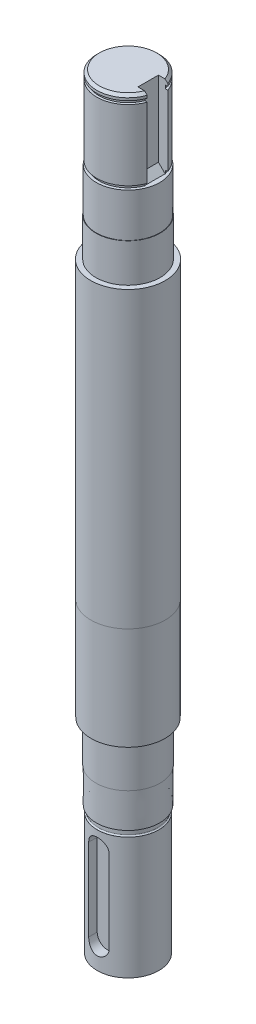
ISO-10303-21;
HEADER;
FILE_DESCRIPTION(('STEP AP214'),'2;1');
FILE_NAME('part.step','',(''),(''),'','','');
FILE_SCHEMA(('AUTOMOTIVE_DESIGN { 1 0 10303 214 1 1 1 1 }'));
ENDSEC;
DATA;
#1=APPLICATION_CONTEXT('core data for automotive mechanical design processes');
#2=APPLICATION_PROTOCOL_DEFINITION('international standard','automotive_design',2000,#1);
#3=PRODUCT_CONTEXT('',#1,'mechanical');
#4=PRODUCT('Part','Part','',(#3));
#5=PRODUCT_RELATED_PRODUCT_CATEGORY('part','',(#4));
#6=PRODUCT_DEFINITION_FORMATION('','',#4);
#7=PRODUCT_DEFINITION_CONTEXT('part definition',#1,'design');
#8=PRODUCT_DEFINITION('design','',#6,#7);
#9=PRODUCT_DEFINITION_SHAPE('','',#8);
#10=(LENGTH_UNIT() NAMED_UNIT(*) SI_UNIT(.MILLI.,.METRE.));
#11=(NAMED_UNIT(*) PLANE_ANGLE_UNIT() SI_UNIT($,.RADIAN.));
#12=(NAMED_UNIT(*) SI_UNIT($,.STERADIAN.) SOLID_ANGLE_UNIT());
#13=UNCERTAINTY_MEASURE_WITH_UNIT(LENGTH_MEASURE(1.E-05),#10,'distance_accuracy_value','');
#14=(GEOMETRIC_REPRESENTATION_CONTEXT(3) GLOBAL_UNCERTAINTY_ASSIGNED_CONTEXT((#13)) GLOBAL_UNIT_ASSIGNED_CONTEXT((#10,
#11,#12)) REPRESENTATION_CONTEXT('',''));
#15=CARTESIAN_POINT('',(0.,0.,0.));
#16=DIRECTION('',(0.,0.,1.));
#17=DIRECTION('',(1.,0.,0.));
#18=AXIS2_PLACEMENT_3D('',#15,#16,#17);
#19=CARTESIAN_POINT('',(12.,50.,0.));
#20=DIRECTION('',(0.,-1.,0.));
#21=DIRECTION('',(0.,0.,-1.));
#22=AXIS2_PLACEMENT_3D('',#19,#20,#21);
#23=PLANE('',#22);
#24=CARTESIAN_POINT('',(0.,50.,0.));
#25=DIRECTION('',(0.,-1.,0.));
#26=DIRECTION('',(0.,0.,-1.));
#27=AXIS2_PLACEMENT_3D('',#24,#25,#26);
#28=CIRCLE('',#27,12.35);
#29=CARTESIAN_POINT('',(0.,50.,-12.35));
#30=VERTEX_POINT('',#29);
#31=EDGE_CURVE('E297',#30,#30,#28,.T.);
#32=ORIENTED_EDGE('',*,*,#31,.T.);
#33=EDGE_LOOP('',(#32));
#34=FACE_BOUND('',#33,.T.);
#35=CARTESIAN_POINT('',(0.,50.,0.));
#36=DIRECTION('',(0.,-1.,0.));
#37=DIRECTION('',(0.,0.,-1.));
#38=AXIS2_PLACEMENT_3D('',#35,#36,#37);
#39=CIRCLE('',#38,11.99);
#40=CARTESIAN_POINT('',(0.,50.,-11.99));
#41=VERTEX_POINT('',#40);
#42=EDGE_CURVE('E221',#41,#41,#39,.T.);
#43=ORIENTED_EDGE('',*,*,#42,.F.);
#44=EDGE_LOOP('',(#43));
#45=FACE_BOUND('',#44,.T.);
#46=ADVANCED_FACE('F35',(#34,#45),#23,.T.);
#47=CARTESIAN_POINT('',(0.,50.,0.));
#48=DIRECTION('',(0.,-1.,0.));
#49=DIRECTION('',(0.,0.,-1.));
#50=AXIS2_PLACEMENT_3D('',#47,#48,#49);
#51=CONICAL_SURFACE('',#50,12.35,0.000540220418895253);
#52=CARTESIAN_POINT('',(0.,63.5,0.));
#53=DIRECTION('',(0.,-1.,0.));
#54=DIRECTION('',(0.,0.,-1.));
#55=AXIS2_PLACEMENT_3D('',#52,#53,#54);
#56=CIRCLE('',#55,12.3427070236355);
#57=CARTESIAN_POINT('',(0.,63.5,-12.3427070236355));
#58=VERTEX_POINT('',#57);
#59=EDGE_CURVE('E294',#58,#58,#56,.T.);
#60=ORIENTED_EDGE('',*,*,#59,.T.);
#61=EDGE_LOOP('',(#60));
#62=FACE_BOUND('',#61,.T.);
#63=ORIENTED_EDGE('',*,*,#31,.F.);
#64=EDGE_LOOP('',(#63));
#65=FACE_BOUND('',#64,.T.);
#66=ADVANCED_FACE('F378',(#62,#65),#51,.T.);
#67=CARTESIAN_POINT('',(12.5,63.5,0.));
#68=DIRECTION('',(0.,-1.,0.));
#69=DIRECTION('',(0.,0.,-1.));
#70=AXIS2_PLACEMENT_3D('',#67,#68,#69);
#71=PLANE('',#70);
#72=CARTESIAN_POINT('',(0.,63.5,0.));
#73=DIRECTION('',(0.,-1.,0.));
#74=DIRECTION('',(0.,0.,-1.));
#75=AXIS2_PLACEMENT_3D('',#72,#73,#74);
#76=CIRCLE('',#75,12.5);
#77=CARTESIAN_POINT('',(0.,63.5,-12.5));
#78=VERTEX_POINT('',#77);
#79=EDGE_CURVE('E291',#78,#78,#76,.T.);
#80=ORIENTED_EDGE('',*,*,#79,.T.);
#81=EDGE_LOOP('',(#80));
#82=FACE_BOUND('',#81,.T.);
#83=ORIENTED_EDGE('',*,*,#59,.F.);
#84=EDGE_LOOP('',(#83));
#85=FACE_BOUND('',#84,.T.);
#86=ADVANCED_FACE('F383',(#82,#85),#71,.T.);
#87=CARTESIAN_POINT('',(0.,326.056951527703,0.));
#88=DIRECTION('',(0.,-1.,0.));
#89=DIRECTION('',(0.,0.,-1.));
#90=AXIS2_PLACEMENT_3D('',#87,#88,#89);
#91=CYLINDRICAL_SURFACE('',#90,12.5);
#92=CARTESIAN_POINT('',(0.,79.5,0.));
#93=DIRECTION('',(0.,-1.,0.));
#94=DIRECTION('',(0.,0.,-1.));
#95=AXIS2_PLACEMENT_3D('',#92,#93,#94);
#96=CIRCLE('',#95,12.5);
#97=CARTESIAN_POINT('',(0.,79.5,-12.5));
#98=VERTEX_POINT('',#97);
#99=EDGE_CURVE('E288',#98,#98,#96,.T.);
#100=ORIENTED_EDGE('',*,*,#99,.T.);
#101=EDGE_LOOP('',(#100));
#102=FACE_BOUND('',#101,.T.);
#103=ORIENTED_EDGE('',*,*,#79,.F.);
#104=EDGE_LOOP('',(#103));
#105=FACE_BOUND('',#104,.T.);
#106=ADVANCED_FACE('F390',(#102,#105),#91,.T.);
#107=CARTESIAN_POINT('',(12.5,79.5,0.));
#108=DIRECTION('',(0.,-1.,0.));
#109=DIRECTION('',(0.,0.,-1.));
#110=AXIS2_PLACEMENT_3D('',#107,#108,#109);
#111=PLANE('',#110);
#112=CARTESIAN_POINT('',(0.,79.5,0.));
#113=DIRECTION('',(0.,-1.,0.));
#114=DIRECTION('',(0.,0.,-1.));
#115=AXIS2_PLACEMENT_3D('',#112,#113,#114);
#116=CIRCLE('',#115,14.4);
#117=CARTESIAN_POINT('',(0.,79.5,-14.4));
#118=VERTEX_POINT('',#117);
#119=EDGE_CURVE('E285',#118,#118,#116,.T.);
#120=ORIENTED_EDGE('',*,*,#119,.T.);
#121=EDGE_LOOP('',(#120));
#122=FACE_BOUND('',#121,.T.);
#123=ORIENTED_EDGE('',*,*,#99,.F.);
#124=EDGE_LOOP('',(#123));
#125=FACE_BOUND('',#124,.T.);
#126=ADVANCED_FACE('F394',(#122,#125),#111,.T.);
#127=CARTESIAN_POINT('',(0.,326.056951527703,0.));
#128=DIRECTION('',(0.,-1.,0.));
#129=DIRECTION('',(0.,0.,-1.));
#130=AXIS2_PLACEMENT_3D('',#127,#128,#129);
#131=CYLINDRICAL_SURFACE('',#130,14.4);
#132=CARTESIAN_POINT('',(0.,119.5,0.));
#133=DIRECTION('',(0.,-1.,0.));
#134=DIRECTION('',(0.,0.,-1.));
#135=AXIS2_PLACEMENT_3D('',#132,#133,#134);
#136=CIRCLE('',#135,14.4);
#137=CARTESIAN_POINT('',(0.,119.5,-14.4));
#138=VERTEX_POINT('',#137);
#139=EDGE_CURVE('E282',#138,#138,#136,.T.);
#140=ORIENTED_EDGE('',*,*,#139,.T.);
#141=EDGE_LOOP('',(#140));
#142=FACE_BOUND('',#141,.T.);
#143=ORIENTED_EDGE('',*,*,#119,.F.);
#144=EDGE_LOOP('',(#143));
#145=FACE_BOUND('',#144,.T.);
#146=ADVANCED_FACE('F398',(#142,#145),#131,.T.);
#147=CARTESIAN_POINT('',(14.5,119.5,0.));
#148=DIRECTION('',(0.,-1.,0.));
#149=DIRECTION('',(0.,0.,-1.));
#150=AXIS2_PLACEMENT_3D('',#147,#148,#149);
#151=PLANE('',#150);
#152=CARTESIAN_POINT('',(0.,119.5,0.));
#153=DIRECTION('',(0.,-1.,0.));
#154=DIRECTION('',(0.,0.,-1.));
#155=AXIS2_PLACEMENT_3D('',#152,#153,#154);
#156=CIRCLE('',#155,14.5);
#157=CARTESIAN_POINT('',(0.,119.5,-14.5));
#158=VERTEX_POINT('',#157);
#159=EDGE_CURVE('E279',#158,#158,#156,.T.);
#160=ORIENTED_EDGE('',*,*,#159,.T.);
#161=EDGE_LOOP('',(#160));
#162=FACE_BOUND('',#161,.T.);
#163=ORIENTED_EDGE('',*,*,#139,.F.);
#164=EDGE_LOOP('',(#163));
#165=FACE_BOUND('',#164,.T.);
#166=ADVANCED_FACE('F402',(#162,#165),#151,.T.);
#167=CARTESIAN_POINT('',(0.,326.056951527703,0.));
#168=DIRECTION('',(0.,-1.,0.));
#169=DIRECTION('',(0.,0.,-1.));
#170=AXIS2_PLACEMENT_3D('',#167,#168,#169);
#171=CYLINDRICAL_SURFACE('',#170,14.5);
#172=CARTESIAN_POINT('',(0.,234.,0.));
#173=DIRECTION('',(0.,-1.,0.));
#174=DIRECTION('',(0.,0.,-1.));
#175=AXIS2_PLACEMENT_3D('',#172,#173,#174);
#176=CIRCLE('',#175,14.5000000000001);
#177=CARTESIAN_POINT('',(0.,234.,-14.5000000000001));
#178=VERTEX_POINT('',#177);
#179=EDGE_CURVE('E276',#178,#178,#176,.T.);
#180=ORIENTED_EDGE('',*,*,#179,.T.);
#181=EDGE_LOOP('',(#180));
#182=FACE_BOUND('',#181,.T.);
#183=ORIENTED_EDGE('',*,*,#159,.F.);
#184=EDGE_LOOP('',(#183));
#185=FACE_BOUND('',#184,.T.);
#186=ADVANCED_FACE('F406',(#182,#185),#171,.T.);
#187=CARTESIAN_POINT('',(14.5000000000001,234.,0.));
#188=DIRECTION('',(0.,1.,0.));
#189=DIRECTION('',(0.,0.,1.));
#190=AXIS2_PLACEMENT_3D('',#187,#188,#189);
#191=PLANE('',#190);
#192=CARTESIAN_POINT('',(0.,234.,0.));
#193=DIRECTION('',(0.,-1.,0.));
#194=DIRECTION('',(0.,0.,-1.));
#195=AXIS2_PLACEMENT_3D('',#192,#193,#194);
#196=CIRCLE('',#195,12.5);
#197=CARTESIAN_POINT('',(0.,234.,-12.5));
#198=VERTEX_POINT('',#197);
#199=EDGE_CURVE('E273',#198,#198,#196,.T.);
#200=ORIENTED_EDGE('',*,*,#199,.T.);
#201=EDGE_LOOP('',(#200));
#202=FACE_BOUND('',#201,.T.);
#203=ORIENTED_EDGE('',*,*,#179,.F.);
#204=EDGE_LOOP('',(#203));
#205=FACE_BOUND('',#204,.T.);
#206=ADVANCED_FACE('F410',(#202,#205),#191,.T.);
#207=CARTESIAN_POINT('',(0.,326.056951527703,0.));
#208=DIRECTION('',(0.,-1.,0.));
#209=DIRECTION('',(0.,0.,-1.));
#210=AXIS2_PLACEMENT_3D('',#207,#208,#209);
#211=CYLINDRICAL_SURFACE('',#210,12.5);
#212=CARTESIAN_POINT('',(0.,249.,0.));
#213=DIRECTION('',(0.,-1.,0.));
#214=DIRECTION('',(0.,0.,-1.));
#215=AXIS2_PLACEMENT_3D('',#212,#213,#214);
#216=CIRCLE('',#215,12.5);
#217=CARTESIAN_POINT('',(0.,249.,-12.5));
#218=VERTEX_POINT('',#217);
#219=EDGE_CURVE('E270',#218,#218,#216,.T.);
#220=ORIENTED_EDGE('',*,*,#219,.T.);
#221=EDGE_LOOP('',(#220));
#222=FACE_BOUND('',#221,.T.);
#223=ORIENTED_EDGE('',*,*,#199,.F.);
#224=EDGE_LOOP('',(#223));
#225=FACE_BOUND('',#224,.T.);
#226=ADVANCED_FACE('F414',(#222,#225),#211,.T.);
#227=CARTESIAN_POINT('',(12.5,249.,0.));
#228=DIRECTION('',(0.,1.,0.));
#229=DIRECTION('',(0.,0.,1.));
#230=AXIS2_PLACEMENT_3D('',#227,#228,#229);
#231=PLANE('',#230);
#232=CARTESIAN_POINT('',(0.,249.,0.));
#233=DIRECTION('',(0.,-1.,0.));
#234=DIRECTION('',(0.,0.,-1.));
#235=AXIS2_PLACEMENT_3D('',#232,#233,#234);
#236=CIRCLE('',#235,12.35);
#237=CARTESIAN_POINT('',(0.,249.,-12.35));
#238=VERTEX_POINT('',#237);
#239=EDGE_CURVE('E267',#238,#238,#236,.T.);
#240=ORIENTED_EDGE('',*,*,#239,.T.);
#241=EDGE_LOOP('',(#240));
#242=FACE_BOUND('',#241,.T.);
#243=ORIENTED_EDGE('',*,*,#219,.F.);
#244=EDGE_LOOP('',(#243));
#245=FACE_BOUND('',#244,.T.);
#246=ADVANCED_FACE('F418',(#242,#245),#231,.T.);
#247=CARTESIAN_POINT('',(0.,326.056951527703,0.));
#248=DIRECTION('',(0.,-1.,0.));
#249=DIRECTION('',(0.,0.,-1.));
#250=AXIS2_PLACEMENT_3D('',#247,#248,#249);
#251=CYLINDRICAL_SURFACE('',#250,12.35);
#252=CARTESIAN_POINT('',(0.,266.,0.));
#253=DIRECTION('',(0.,-1.,0.));
#254=DIRECTION('',(0.,0.,-1.));
#255=AXIS2_PLACEMENT_3D('',#252,#253,#254);
#256=CIRCLE('',#255,12.35);
#257=CARTESIAN_POINT('',(0.,266.,-12.35));
#258=VERTEX_POINT('',#257);
#259=EDGE_CURVE('E264',#258,#258,#256,.T.);
#260=ORIENTED_EDGE('',*,*,#259,.T.);
#261=EDGE_LOOP('',(#260));
#262=FACE_BOUND('',#261,.T.);
#263=ORIENTED_EDGE('',*,*,#239,.F.);
#264=EDGE_LOOP('',(#263));
#265=FACE_BOUND('',#264,.T.);
#266=ADVANCED_FACE('F422',(#262,#265),#251,.T.);
#267=CARTESIAN_POINT('',(12.35,266.,0.));
#268=DIRECTION('',(0.,1.,0.));
#269=DIRECTION('',(0.,0.,1.));
#270=AXIS2_PLACEMENT_3D('',#267,#268,#269);
#271=PLANE('',#270);
#272=DIRECTION('',(1.,0.,0.));
#273=VECTOR('',#272,1.);
#274=CARTESIAN_POINT('',(7.85,266.,-4.));
#275=LINE('',#274,#273);
#276=CARTESIAN_POINT('',(10.45,266.,-4.));
#277=VERTEX_POINT('',#276);
#278=CARTESIAN_POINT('',(10.5226729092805,266.,-3.99999999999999));
#279=VERTEX_POINT('',#278);
#280=EDGE_CURVE('E170',#277,#279,#275,.T.);
#281=ORIENTED_EDGE('',*,*,#280,.F.);
#282=DIRECTION('',(0.,0.,1.));
#283=VECTOR('',#282,1.);
#284=CARTESIAN_POINT('',(10.45,266.,4.));
#285=LINE('',#284,#283);
#286=CARTESIAN_POINT('',(10.45,266.,4.));
#287=VERTEX_POINT('',#286);
#288=EDGE_CURVE('E43',#277,#287,#285,.T.);
#289=ORIENTED_EDGE('',*,*,#288,.T.);
#290=DIRECTION('',(1.,0.,0.));
#291=VECTOR('',#290,1.);
#292=CARTESIAN_POINT('',(7.85,266.,4.));
#293=LINE('',#292,#291);
#294=CARTESIAN_POINT('',(10.5226729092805,266.,4.));
#295=VERTEX_POINT('',#294);
#296=EDGE_CURVE('E168',#287,#295,#293,.T.);
#297=ORIENTED_EDGE('',*,*,#296,.T.);
#298=CARTESIAN_POINT('',(0.,266.,0.));
#299=DIRECTION('',(0.,-1.,0.));
#300=DIRECTION('',(0.,0.,-1.));
#301=AXIS2_PLACEMENT_3D('',#298,#299,#300);
#302=CIRCLE('',#301,11.2572929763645);
#303=EDGE_CURVE('E261',#295,#279,#302,.T.);
#304=ORIENTED_EDGE('',*,*,#303,.T.);
#305=EDGE_LOOP('',(#281,#289,#297,#304));
#306=FACE_BOUND('',#305,.T.);
#307=ORIENTED_EDGE('',*,*,#259,.F.);
#308=EDGE_LOOP('',(#307));
#309=FACE_BOUND('',#308,.T.);
#310=ADVANCED_FACE('F426',(#306,#309),#271,.T.);
#311=CARTESIAN_POINT('',(0.,326.056951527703,0.));
#312=DIRECTION('',(0.,-1.,0.));
#313=DIRECTION('',(0.,0.,-1.));
#314=AXIS2_PLACEMENT_3D('',#311,#312,#313);
#315=CYLINDRICAL_SURFACE('',#314,11.2572929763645);
#316=DIRECTION('',(0.,-1.,0.));
#317=VECTOR('',#316,1.);
#318=CARTESIAN_POINT('',(10.5226729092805,326.056951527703,-4.));
#319=LINE('',#318,#317);
#320=CARTESIAN_POINT('',(10.5226729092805,267.3,-4.));
#321=VERTEX_POINT('',#320);
#322=EDGE_CURVE('E203',#279,#321,#319,.F.);
#323=ORIENTED_EDGE('',*,*,#322,.F.);
#324=ORIENTED_EDGE('',*,*,#303,.F.);
#325=DIRECTION('',(0.,-1.,0.));
#326=VECTOR('',#325,1.);
#327=CARTESIAN_POINT('',(10.5226729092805,326.056951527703,4.));
#328=LINE('',#327,#326);
#329=CARTESIAN_POINT('',(10.5226729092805,267.3,4.));
#330=VERTEX_POINT('',#329);
#331=EDGE_CURVE('E188',#330,#295,#328,.T.);
#332=ORIENTED_EDGE('',*,*,#331,.F.);
#333=CARTESIAN_POINT('',(0.,267.3,0.));
#334=DIRECTION('',(0.,-1.,0.));
#335=DIRECTION('',(0.,0.,-1.));
#336=AXIS2_PLACEMENT_3D('',#333,#334,#335);
#337=CIRCLE('',#336,11.2572929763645);
#338=EDGE_CURVE('E258',#330,#321,#337,.T.);
#339=ORIENTED_EDGE('',*,*,#338,.T.);
#340=EDGE_LOOP('',(#323,#324,#332,#339));
#341=FACE_BOUND('',#340,.T.);
#342=ADVANCED_FACE('F430',(#341),#315,.T.);
#343=CARTESIAN_POINT('',(11.2572929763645,267.3,0.));
#344=DIRECTION('',(0.,-1.,0.));
#345=DIRECTION('',(0.,0.,-1.));
#346=AXIS2_PLACEMENT_3D('',#343,#344,#345);
#347=PLANE('',#346);
#348=DIRECTION('',(1.,0.,0.));
#349=VECTOR('',#348,1.);
#350=CARTESIAN_POINT('',(11.2572929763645,267.3,-4.));
#351=LINE('',#350,#349);
#352=CARTESIAN_POINT('',(11.472684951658,267.3,-4.));
#353=VERTEX_POINT('',#352);
#354=EDGE_CURVE('E201',#321,#353,#351,.T.);
#355=ORIENTED_EDGE('',*,*,#354,.F.);
#356=ORIENTED_EDGE('',*,*,#338,.F.);
#357=DIRECTION('',(-1.,0.,0.));
#358=VECTOR('',#357,1.);
#359=CARTESIAN_POINT('',(11.2572929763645,267.3,4.));
#360=LINE('',#359,#358);
#361=CARTESIAN_POINT('',(11.472684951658,267.3,4.));
#362=VERTEX_POINT('',#361);
#363=EDGE_CURVE('E186',#362,#330,#360,.T.);
#364=ORIENTED_EDGE('',*,*,#363,.F.);
#365=CARTESIAN_POINT('',(0.,267.3,0.));
#366=DIRECTION('',(0.,-1.,0.));
#367=DIRECTION('',(0.,0.,-1.));
#368=AXIS2_PLACEMENT_3D('',#365,#366,#367);
#369=CIRCLE('',#368,12.15);
#370=EDGE_CURVE('E255',#362,#353,#369,.T.);
#371=ORIENTED_EDGE('',*,*,#370,.T.);
#372=EDGE_LOOP('',(#355,#356,#364,#371));
#373=FACE_BOUND('',#372,.T.);
#374=ADVANCED_FACE('F433',(#373),#347,.T.);
#375=CARTESIAN_POINT('',(0.,326.056951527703,0.));
#376=DIRECTION('',(0.,-1.,0.));
#377=DIRECTION('',(0.,0.,-1.));
#378=AXIS2_PLACEMENT_3D('',#375,#376,#377);
#379=CYLINDRICAL_SURFACE('',#378,12.15);
#380=DIRECTION('',(0.,-1.,0.));
#381=VECTOR('',#380,1.);
#382=CARTESIAN_POINT('',(11.472684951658,326.056951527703,-4.));
#383=LINE('',#382,#381);
#384=CARTESIAN_POINT('',(11.472684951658,294.7,-4.));
#385=VERTEX_POINT('',#384);
#386=EDGE_CURVE('E199',#353,#385,#383,.F.);
#387=ORIENTED_EDGE('',*,*,#386,.F.);
#388=ORIENTED_EDGE('',*,*,#370,.F.);
#389=DIRECTION('',(0.,-1.,0.));
#390=VECTOR('',#389,1.);
#391=CARTESIAN_POINT('',(11.472684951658,326.056951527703,4.));
#392=LINE('',#391,#390);
#393=CARTESIAN_POINT('',(11.472684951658,294.7,4.));
#394=VERTEX_POINT('',#393);
#395=EDGE_CURVE('E184',#394,#362,#392,.T.);
#396=ORIENTED_EDGE('',*,*,#395,.F.);
#397=CARTESIAN_POINT('',(0.,294.7,0.));
#398=DIRECTION('',(0.,-1.,0.));
#399=DIRECTION('',(0.,0.,-1.));
#400=AXIS2_PLACEMENT_3D('',#397,#398,#399);
#401=CIRCLE('',#400,12.15);
#402=EDGE_CURVE('E252',#394,#385,#401,.T.);
#403=ORIENTED_EDGE('',*,*,#402,.T.);
#404=EDGE_LOOP('',(#387,#388,#396,#403));
#405=FACE_BOUND('',#404,.T.);
#406=ADVANCED_FACE('F437',(#405),#379,.T.);
#407=CARTESIAN_POINT('',(11.2499999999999,294.7,0.));
#408=DIRECTION('',(0.,1.,0.));
#409=DIRECTION('',(0.,0.,1.));
#410=AXIS2_PLACEMENT_3D('',#407,#408,#409);
#411=PLANE('',#410);
#412=DIRECTION('',(-1.,0.,0.));
#413=VECTOR('',#412,1.);
#414=CARTESIAN_POINT('',(11.2499999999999,294.7,-4.));
#415=LINE('',#414,#413);
#416=CARTESIAN_POINT('',(10.5148704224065,294.7,-4.));
#417=VERTEX_POINT('',#416);
#418=EDGE_CURVE('E197',#385,#417,#415,.T.);
#419=ORIENTED_EDGE('',*,*,#418,.F.);
#420=ORIENTED_EDGE('',*,*,#402,.F.);
#421=DIRECTION('',(1.,0.,0.));
#422=VECTOR('',#421,1.);
#423=CARTESIAN_POINT('',(11.2499999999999,294.7,4.));
#424=LINE('',#423,#422);
#425=CARTESIAN_POINT('',(10.5148704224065,294.7,4.));
#426=VERTEX_POINT('',#425);
#427=EDGE_CURVE('E182',#426,#394,#424,.T.);
#428=ORIENTED_EDGE('',*,*,#427,.F.);
#429=CARTESIAN_POINT('',(0.,294.7,0.));
#430=DIRECTION('',(0.,-1.,0.));
#431=DIRECTION('',(0.,0.,-1.));
#432=AXIS2_PLACEMENT_3D('',#429,#430,#431);
#433=CIRCLE('',#432,11.2499999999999);
#434=EDGE_CURVE('E249',#426,#417,#433,.T.);
#435=ORIENTED_EDGE('',*,*,#434,.T.);
#436=EDGE_LOOP('',(#419,#420,#428,#435));
#437=FACE_BOUND('',#436,.T.);
#438=ADVANCED_FACE('F441',(#437),#411,.T.);
#439=CARTESIAN_POINT('',(0.,326.056951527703,0.));
#440=DIRECTION('',(0.,-1.,0.));
#441=DIRECTION('',(0.,0.,-1.));
#442=AXIS2_PLACEMENT_3D('',#439,#440,#441);
#443=CYLINDRICAL_SURFACE('',#442,11.2499999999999);
#444=DIRECTION('',(0.,-1.,0.));
#445=VECTOR('',#444,1.);
#446=CARTESIAN_POINT('',(10.5148704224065,326.056951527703,-4.));
#447=LINE('',#446,#445);
#448=CARTESIAN_POINT('',(10.5148704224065,296.,-4.));
#449=VERTEX_POINT('',#448);
#450=EDGE_CURVE('E195',#417,#449,#447,.F.);
#451=ORIENTED_EDGE('',*,*,#450,.F.);
#452=ORIENTED_EDGE('',*,*,#434,.F.);
#453=DIRECTION('',(0.,-1.,0.));
#454=VECTOR('',#453,1.);
#455=CARTESIAN_POINT('',(10.5148704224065,326.056951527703,4.));
#456=LINE('',#455,#454);
#457=CARTESIAN_POINT('',(10.5148704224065,296.,4.));
#458=VERTEX_POINT('',#457);
#459=EDGE_CURVE('E180',#458,#426,#456,.T.);
#460=ORIENTED_EDGE('',*,*,#459,.F.);
#461=CARTESIAN_POINT('',(0.,296.,0.));
#462=DIRECTION('',(0.,-1.,0.));
#463=DIRECTION('',(0.,0.,-1.));
#464=AXIS2_PLACEMENT_3D('',#461,#462,#463);
#465=CIRCLE('',#464,11.2499999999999);
#466=EDGE_CURVE('E246',#458,#449,#465,.T.);
#467=ORIENTED_EDGE('',*,*,#466,.T.);
#468=EDGE_LOOP('',(#451,#452,#460,#467));
#469=FACE_BOUND('',#468,.T.);
#470=ADVANCED_FACE('F445',(#469),#443,.T.);
#471=CARTESIAN_POINT('',(12.15,296.,0.));
#472=DIRECTION('',(0.,-1.,0.));
#473=DIRECTION('',(0.,0.,-1.));
#474=AXIS2_PLACEMENT_3D('',#471,#472,#473);
#475=PLANE('',#474);
#476=DIRECTION('',(1.,0.,0.));
#477=VECTOR('',#476,1.);
#478=CARTESIAN_POINT('',(12.15,296.,-4.));
#479=LINE('',#478,#477);
#480=CARTESIAN_POINT('',(11.472684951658,296.,-4.));
#481=VERTEX_POINT('',#480);
#482=EDGE_CURVE('E193',#449,#481,#479,.T.);
#483=ORIENTED_EDGE('',*,*,#482,.F.);
#484=ORIENTED_EDGE('',*,*,#466,.F.);
#485=DIRECTION('',(-1.,0.,0.));
#486=VECTOR('',#485,1.);
#487=CARTESIAN_POINT('',(12.15,296.,4.));
#488=LINE('',#487,#486);
#489=CARTESIAN_POINT('',(11.472684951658,296.,4.));
#490=VERTEX_POINT('',#489);
#491=EDGE_CURVE('E177',#490,#458,#488,.T.);
#492=ORIENTED_EDGE('',*,*,#491,.F.);
#493=CARTESIAN_POINT('',(0.,296.,0.));
#494=DIRECTION('',(0.,-1.,0.));
#495=DIRECTION('',(0.,0.,-1.));
#496=AXIS2_PLACEMENT_3D('',#493,#494,#495);
#497=CIRCLE('',#496,12.15);
#498=EDGE_CURVE('E243',#490,#481,#497,.T.);
#499=ORIENTED_EDGE('',*,*,#498,.T.);
#500=EDGE_LOOP('',(#483,#484,#492,#499));
#501=FACE_BOUND('',#500,.T.);
#502=ADVANCED_FACE('F449',(#501),#475,.T.);
#503=CARTESIAN_POINT('',(0.,326.056951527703,0.));
#504=DIRECTION('',(0.,-1.,0.));
#505=DIRECTION('',(0.,0.,-1.));
#506=AXIS2_PLACEMENT_3D('',#503,#504,#505);
#507=CYLINDRICAL_SURFACE('',#506,12.15);
#508=DIRECTION('',(0.,-1.,0.));
#509=VECTOR('',#508,1.);
#510=CARTESIAN_POINT('',(11.472684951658,326.056951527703,-4.));
#511=LINE('',#510,#509);
#512=CARTESIAN_POINT('',(11.472684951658,297.,-4.));
#513=VERTEX_POINT('',#512);
#514=EDGE_CURVE('E191',#481,#513,#511,.F.);
#515=ORIENTED_EDGE('',*,*,#514,.F.);
#516=ORIENTED_EDGE('',*,*,#498,.F.);
#517=DIRECTION('',(0.,-1.,0.));
#518=VECTOR('',#517,1.);
#519=CARTESIAN_POINT('',(11.472684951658,326.056951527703,4.));
#520=LINE('',#519,#518);
#521=CARTESIAN_POINT('',(11.472684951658,297.,4.));
#522=VERTEX_POINT('',#521);
#523=EDGE_CURVE('E175',#522,#490,#520,.T.);
#524=ORIENTED_EDGE('',*,*,#523,.F.);
#525=CARTESIAN_POINT('',(0.,297.,0.));
#526=DIRECTION('',(0.,1.,0.));
#527=DIRECTION('',(0.,0.,1.));
#528=AXIS2_PLACEMENT_3D('',#525,#526,#527);
#529=CIRCLE('',#528,12.15);
#530=EDGE_CURVE('E303',#522,#513,#529,.F.);
#531=ORIENTED_EDGE('',*,*,#530,.T.);
#532=EDGE_LOOP('',(#515,#516,#524,#531));
#533=FACE_BOUND('',#532,.T.);
#534=ADVANCED_FACE('F453',(#533),#507,.T.);
#535=CARTESIAN_POINT('',(12.15,298.,0.));
#536=DIRECTION('',(0.,1.,0.));
#537=DIRECTION('',(0.,0.,1.));
#538=AXIS2_PLACEMENT_3D('',#535,#536,#537);
#539=PLANE('',#538);
#540=DIRECTION('',(1.,0.,0.));
#541=VECTOR('',#540,1.);
#542=CARTESIAN_POINT('',(7.85,298.,-4.));
#543=LINE('',#542,#541);
#544=CARTESIAN_POINT('',(7.85,298.,-4.));
#545=VERTEX_POINT('',#544);
#546=CARTESIAN_POINT('',(10.4078095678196,298.,-4.));
#547=VERTEX_POINT('',#546);
#548=EDGE_CURVE('E178',#545,#547,#543,.T.);
#549=ORIENTED_EDGE('',*,*,#548,.T.);
#550=CARTESIAN_POINT('',(0.,298.,0.));
#551=DIRECTION('',(0.,1.,0.));
#552=DIRECTION('',(0.,0.,1.));
#553=AXIS2_PLACEMENT_3D('',#550,#551,#552);
#554=CIRCLE('',#553,11.1499999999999);
#555=CARTESIAN_POINT('',(10.4078095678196,298.,4.));
#556=VERTEX_POINT('',#555);
#557=EDGE_CURVE('E167',#547,#556,#554,.T.);
#558=ORIENTED_EDGE('',*,*,#557,.T.);
#559=DIRECTION('',(1.,0.,0.));
#560=VECTOR('',#559,1.);
#561=CARTESIAN_POINT('',(7.85,298.,4.));
#562=LINE('',#561,#560);
#563=CARTESIAN_POINT('',(7.85,298.,4.));
#564=VERTEX_POINT('',#563);
#565=EDGE_CURVE('E149',#564,#556,#562,.T.);
#566=ORIENTED_EDGE('',*,*,#565,.F.);
#567=DIRECTION('',(0.,0.,1.));
#568=VECTOR('',#567,1.);
#569=CARTESIAN_POINT('',(7.85,298.,4.));
#570=LINE('',#569,#568);
#571=EDGE_CURVE('E156',#545,#564,#570,.T.);
#572=ORIENTED_EDGE('',*,*,#571,.F.);
#573=EDGE_LOOP('',(#549,#558,#566,#572));
#574=FACE_BOUND('',#573,.T.);
#575=ADVANCED_FACE('F165',(#574),#539,.T.);
#576=CARTESIAN_POINT('',(0.,297.,0.));
#577=DIRECTION('',(0.,-1.,0.));
#578=DIRECTION('',(0.,0.,-1.));
#579=AXIS2_PLACEMENT_3D('',#576,#577,#578);
#580=CONICAL_SURFACE('',#579,12.15,0.785398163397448);
#581=CARTESIAN_POINT('',(16.7200622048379,291.958127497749,-4.));
#582=CARTESIAN_POINT('',(16.223932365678,292.440582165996,-4.));
#583=CARTESIAN_POINT('',(15.7272759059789,292.92249878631,-4.));
#584=CARTESIAN_POINT('',(14.7324625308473,293.88471369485,-4.));
#585=CARTESIAN_POINT('',(14.2343057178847,294.365012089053,-4.));
#586=CARTESIAN_POINT('',(13.236269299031,295.32323347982,-4.));
#587=CARTESIAN_POINT('',(12.7363908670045,295.801157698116,-4.));
#588=CARTESIAN_POINT('',(11.7338109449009,296.75411902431,-4.));
#589=CARTESIAN_POINT('',(11.2311092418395,297.229155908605,-4.));
#590=CARTESIAN_POINT('',(10.4738218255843,297.938700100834,-4.));
#591=CARTESIAN_POINT('',(10.2207427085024,298.174815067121,-4.));
#592=CARTESIAN_POINT('',(9.71334660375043,298.645708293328,-4.));
#593=CARTESIAN_POINT('',(9.45902962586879,298.880486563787,-4.));
#594=CARTESIAN_POINT('',(8.94891205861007,299.34833217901,-4.));
#595=CARTESIAN_POINT('',(8.69311175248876,299.581399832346,-4.));
#596=CARTESIAN_POINT('',(8.17958053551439,300.045417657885,-4.));
#597=CARTESIAN_POINT('',(7.92184956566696,300.2763677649,-4.));
#598=CARTESIAN_POINT('',(7.40373040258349,300.735676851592,-4.));
#599=CARTESIAN_POINT('',(7.14334031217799,300.964033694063,-4.));
#600=CARTESIAN_POINT('',(6.61937633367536,301.417035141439,-4.));
#601=CARTESIAN_POINT('',(6.35580272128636,301.641680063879,-4.));
#602=CARTESIAN_POINT('',(5.95714867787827,301.974880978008,-4.));
#603=CARTESIAN_POINT('',(5.82367153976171,302.085355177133,-4.));
#604=CARTESIAN_POINT('',(5.55546367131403,302.304766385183,-4.));
#605=CARTESIAN_POINT('',(5.42073297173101,302.413703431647,-4.));
#606=CARTESIAN_POINT('',(5.14976483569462,302.629772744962,-4.));
#607=CARTESIAN_POINT('',(5.01352697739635,302.736904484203,-4.));
#608=CARTESIAN_POINT('',(4.73929378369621,302.948916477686,-4.));
#609=CARTESIAN_POINT('',(4.60129830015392,303.05379654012,-4.));
#610=CARTESIAN_POINT('',(4.46229111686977,303.15733431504,-4.));
#611=B_SPLINE_CURVE_WITH_KNOTS('',3,(#581,#582,#583,#584,#585,#586,#587,#588,#589,#590,#591,
#592,#593,#594,#595,#596,#597,#598,#599,#600,#601,#602,#603,#604,#605,#606,#607,#608,#609,#610),
.UNSPECIFIED.,.F.,.F.,(4,2,2,2,2,2,2,2,2,2,2,2,2,2,4),(0.,2.07609728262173,4.15205585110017,
6.22680399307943,8.30171081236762,9.3400683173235,10.3784176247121,11.4165747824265,
12.4547637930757,13.4937540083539,14.5326548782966,15.0524402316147,15.5722128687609,
16.0921348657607,16.6121009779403),.UNSPECIFIED.);
#612=EDGE_CURVE('E358',#513,#547,#611,.T.);
#613=ORIENTED_EDGE('',*,*,#612,.F.);
#614=ORIENTED_EDGE('',*,*,#530,.F.);
#615=CARTESIAN_POINT('',(4.46229111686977,303.15733431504,4.));
#616=CARTESIAN_POINT('',(4.58005525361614,303.069628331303,4.));
#617=CARTESIAN_POINT('',(4.69708938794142,302.980951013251,4.));
#618=CARTESIAN_POINT('',(4.9298660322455,302.801929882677,4.));
#619=CARTESIAN_POINT('',(5.04560861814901,302.711586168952,4.));
#620=CARTESIAN_POINT('',(5.27595889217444,302.529518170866,4.));
#621=CARTESIAN_POINT('',(5.39056682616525,302.437794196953,4.));
#622=CARTESIAN_POINT('',(5.61881468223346,302.253147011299,4.));
#623=CARTESIAN_POINT('',(5.73245458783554,302.160223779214,4.));
#624=CARTESIAN_POINT('',(6.07198795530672,301.880016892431,4.));
#625=CARTESIAN_POINT('',(6.29661620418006,301.691199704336,4.));
#626=CARTESIAN_POINT('',(6.74326298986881,301.310485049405,4.));
#627=CARTESIAN_POINT('',(6.96528135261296,301.118587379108,4.));
#628=CARTESIAN_POINT('',(7.40707587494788,300.732563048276,4.));
#629=CARTESIAN_POINT('',(7.62685358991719,300.538438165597,4.));
#630=CARTESIAN_POINT('',(8.06473874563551,300.148326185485,4.));
#631=CARTESIAN_POINT('',(8.28284622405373,299.952339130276,4.));
#632=CARTESIAN_POINT('',(8.71772960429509,299.558845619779,4.));
#633=CARTESIAN_POINT('',(8.93450535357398,299.36133899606,4.));
#634=CARTESIAN_POINT('',(9.36693981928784,298.965106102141,4.));
#635=CARTESIAN_POINT('',(9.5825985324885,298.766379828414,4.));
#636=CARTESIAN_POINT('',(9.87539718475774,298.495300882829,4.));
#637=CARTESIAN_POINT('',(9.95294288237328,298.423385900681,4.));
#638=CARTESIAN_POINT('',(10.1079187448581,298.279434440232,4.));
#639=CARTESIAN_POINT('',(10.1853489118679,298.207397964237,4.));
#640=CARTESIAN_POINT('',(10.4174886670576,297.991105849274,4.));
#641=CARTESIAN_POINT('',(10.5720370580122,297.84667720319,4.));
#642=CARTESIAN_POINT('',(11.2313161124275,297.228960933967,4.));
#643=CARTESIAN_POINT('',(11.734224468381,296.753727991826,4.));
#644=CARTESIAN_POINT('',(12.7372584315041,295.800331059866,4.));
#645=CARTESIAN_POINT('',(13.2373840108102,295.322167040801,4.));
#646=CARTESIAN_POINT('',(14.2354612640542,294.363898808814,4.));
#647=CARTESIAN_POINT('',(14.7334135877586,293.883795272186,4.));
#648=CARTESIAN_POINT('',(15.7277734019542,292.922016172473,4.));
#649=CARTESIAN_POINT('',(16.2241809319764,292.440340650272,4.));
#650=CARTESIAN_POINT('',(16.7200622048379,291.958127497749,4.));
#651=B_SPLINE_CURVE_WITH_KNOTS('',3,(#615,#616,#617,#618,#619,#620,#621,#622,#623,#624,#625,
#626,#627,#628,#629,#630,#631,#632,#633,#634,#635,#636,#637,#638,#639,#640,#641,#642,#643,#644,
#645,#646,#647,#648,#649,#650),.UNSPECIFIED.,.F.,.F.,(4,2,2,2,2,2,2,2,2,2,2,2,2,2,2,2,2,4),(0.,
0.440494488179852,0.880962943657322,1.32133376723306,1.76171207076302,2.64200442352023,
3.52235515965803,4.40204627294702,5.28171748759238,6.16148765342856,7.04126036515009,
7.35853919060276,7.67581206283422,8.31040054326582,10.3861611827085,12.4619425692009,
14.5370537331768,16.6121113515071),.UNSPECIFIED.);
#652=EDGE_CURVE('E351',#556,#522,#651,.T.);
#653=ORIENTED_EDGE('',*,*,#652,.F.);
#654=ORIENTED_EDGE('',*,*,#557,.F.);
#655=EDGE_LOOP('',(#613,#614,#653,#654));
#656=FACE_BOUND('',#655,.T.);
#657=ADVANCED_FACE('F365',(#656),#580,.T.);
#658=CARTESIAN_POINT('',(12.,47.5,0.));
#659=DIRECTION('',(0.,-1.,0.));
#660=DIRECTION('',(0.,0.,-1.));
#661=AXIS2_PLACEMENT_3D('',#658,#659,#660);
#662=PLANE('',#661);
#663=CARTESIAN_POINT('',(0.,47.5,0.));
#664=DIRECTION('',(0.,-1.,0.));
#665=DIRECTION('',(0.,0.,-1.));
#666=AXIS2_PLACEMENT_3D('',#663,#664,#665);
#667=CIRCLE('',#666,12.);
#668=CARTESIAN_POINT('',(0.,47.5,-12.));
#669=VERTEX_POINT('',#668);
#670=EDGE_CURVE('E240',#669,#669,#667,.T.);
#671=ORIENTED_EDGE('',*,*,#670,.F.);
#672=EDGE_LOOP('',(#671));
#673=FACE_BOUND('',#672,.T.);
#674=CARTESIAN_POINT('',(0.,47.5,0.));
#675=DIRECTION('',(0.,-1.,0.));
#676=DIRECTION('',(0.,0.,-1.));
#677=AXIS2_PLACEMENT_3D('',#674,#675,#676);
#678=CIRCLE('',#677,11.99);
#679=CARTESIAN_POINT('',(0.,47.5,-11.99));
#680=VERTEX_POINT('',#679);
#681=EDGE_CURVE('E237',#680,#680,#678,.T.);
#682=ORIENTED_EDGE('',*,*,#681,.T.);
#683=EDGE_LOOP('',(#682));
#684=FACE_BOUND('',#683,.T.);
#685=ADVANCED_FACE('F460',(#673,#684),#662,.F.);
#686=CARTESIAN_POINT('',(0.,47.99,0.));
#687=DIRECTION('',(0.,-1.,0.));
#688=DIRECTION('',(0.,0.,-1.));
#689=AXIS2_PLACEMENT_3D('',#686,#687,#688);
#690=TOROIDAL_SURFACE('',#689,11.99,0.489999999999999);
#691=ORIENTED_EDGE('',*,*,#681,.F.);
#692=EDGE_LOOP('',(#691));
#693=FACE_BOUND('',#692,.T.);
#694=CARTESIAN_POINT('',(0.,47.99,0.));
#695=DIRECTION('',(0.,-1.,0.));
#696=DIRECTION('',(0.,0.,-1.));
#697=AXIS2_PLACEMENT_3D('',#694,#695,#696);
#698=CIRCLE('',#697,11.5);
#699=CARTESIAN_POINT('',(0.,47.99,-11.5));
#700=VERTEX_POINT('',#699);
#701=EDGE_CURVE('E234',#700,#700,#698,.T.);
#702=ORIENTED_EDGE('',*,*,#701,.T.);
#703=EDGE_LOOP('',(#702));
#704=FACE_BOUND('',#703,.T.);
#705=ADVANCED_FACE('F463',(#693,#704),#690,.F.);
#706=CARTESIAN_POINT('',(0.,0.,0.));
#707=DIRECTION('',(0.,-1.,0.));
#708=DIRECTION('',(0.,0.,-1.));
#709=AXIS2_PLACEMENT_3D('',#706,#707,#708);
#710=CYLINDRICAL_SURFACE('',#709,11.5);
#711=ORIENTED_EDGE('',*,*,#701,.F.);
#712=EDGE_LOOP('',(#711));
#713=FACE_BOUND('',#712,.T.);
#714=CARTESIAN_POINT('',(0.,49.51,0.));
#715=DIRECTION('',(0.,-1.,0.));
#716=DIRECTION('',(0.,0.,-1.));
#717=AXIS2_PLACEMENT_3D('',#714,#715,#716);
#718=CIRCLE('',#717,11.5);
#719=CARTESIAN_POINT('',(0.,49.51,-11.5));
#720=VERTEX_POINT('',#719);
#721=EDGE_CURVE('E231',#720,#720,#718,.T.);
#722=ORIENTED_EDGE('',*,*,#721,.T.);
#723=EDGE_LOOP('',(#722));
#724=FACE_BOUND('',#723,.T.);
#725=ADVANCED_FACE('F466',(#713,#724),#710,.T.);
#726=CARTESIAN_POINT('',(0.,49.51,0.));
#727=DIRECTION('',(0.,-1.,0.));
#728=DIRECTION('',(0.,0.,-1.));
#729=AXIS2_PLACEMENT_3D('',#726,#727,#728);
#730=TOROIDAL_SURFACE('',#729,11.99,0.489999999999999);
#731=ORIENTED_EDGE('',*,*,#721,.F.);
#732=EDGE_LOOP('',(#731));
#733=FACE_BOUND('',#732,.T.);
#734=ORIENTED_EDGE('',*,*,#42,.T.);
#735=EDGE_LOOP('',(#734));
#736=FACE_BOUND('',#735,.T.);
#737=ADVANCED_FACE('F339',(#733,#736),#730,.F.);
#738=CARTESIAN_POINT('',(0.,0.,0.));
#739=DIRECTION('',(0.,-1.,0.));
#740=DIRECTION('',(0.,0.,-1.));
#741=AXIS2_PLACEMENT_3D('',#738,#739,#740);
#742=PLANE('',#741);
#743=CARTESIAN_POINT('',(0.,0.,0.));
#744=DIRECTION('',(0.,-1.,0.));
#745=DIRECTION('',(0.,0.,-1.));
#746=AXIS2_PLACEMENT_3D('',#743,#744,#745);
#747=CIRCLE('',#746,12.);
#748=CARTESIAN_POINT('',(0.,0.,-12.));
#749=VERTEX_POINT('',#748);
#750=EDGE_CURVE('E300',#749,#749,#747,.T.);
#751=ORIENTED_EDGE('',*,*,#750,.T.);
#752=EDGE_LOOP('',(#751));
#753=FACE_BOUND('',#752,.T.);
#754=ADVANCED_FACE('F473',(#753),#742,.T.);
#755=CARTESIAN_POINT('',(0.,326.056951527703,0.));
#756=DIRECTION('',(0.,-1.,0.));
#757=DIRECTION('',(0.,0.,-1.));
#758=AXIS2_PLACEMENT_3D('',#755,#756,#757);
#759=CYLINDRICAL_SURFACE('',#758,12.);
#760=CARTESIAN_POINT('',(4.,41.,11.3137084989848));
#761=CARTESIAN_POINT('',(4.0000143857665,41.1091313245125,11.3136910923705));
#762=CARTESIAN_POINT('',(3.99553419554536,41.2182529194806,11.3152871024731));
#763=CARTESIAN_POINT('',(3.97769673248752,41.4356496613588,11.3215763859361));
#764=CARTESIAN_POINT('',(3.96434185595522,41.5439250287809,11.3262688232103));
#765=CARTESIAN_POINT('',(3.92891935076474,41.7585447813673,11.3386032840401));
#766=CARTESIAN_POINT('',(3.90687756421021,41.8648939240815,11.3462365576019));
#767=CARTESIAN_POINT('',(3.85430689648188,42.0752132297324,11.364201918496));
#768=CARTESIAN_POINT('',(3.82377770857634,42.1791833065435,11.3745341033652));
#769=CARTESIAN_POINT('',(3.71986482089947,42.4863385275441,11.4091190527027));
#770=CARTESIAN_POINT('',(3.63410266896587,42.685086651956,11.4369799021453));
#771=CARTESIAN_POINT('',(3.4322845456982,43.0654028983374,11.4991525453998));
#772=CARTESIAN_POINT('',(3.31620997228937,43.246960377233,11.5334682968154));
#773=CARTESIAN_POINT('',(3.05220793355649,43.5948686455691,11.6061789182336));
#774=CARTESIAN_POINT('',(2.90330055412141,43.7604562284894,11.6446750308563));
#775=CARTESIAN_POINT('',(2.57995313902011,44.0648273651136,11.7205540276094));
#776=CARTESIAN_POINT('',(2.40550856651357,44.203606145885,11.7579367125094));
#777=CARTESIAN_POINT('',(2.03041476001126,44.4539171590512,11.8285552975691));
#778=CARTESIAN_POINT('',(1.82920040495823,44.5646436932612,11.8616574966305));
#779=CARTESIAN_POINT('',(1.40971695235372,44.7503692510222,11.9187843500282));
#780=CARTESIAN_POINT('',(1.19145308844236,44.8253791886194,11.9428117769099));
#781=CARTESIAN_POINT('',(0.752117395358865,44.9349428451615,11.9783628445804));
#782=CARTESIAN_POINT('',(0.531407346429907,44.9708130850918,11.9902923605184));
#783=CARTESIAN_POINT('',(0.0867958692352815,45.0052651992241,12.0017443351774));
#784=CARTESIAN_POINT('',(-0.137104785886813,45.0038559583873,12.0012697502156));
#785=CARTESIAN_POINT('',(-0.572415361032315,44.9646229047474,11.9882415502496));
#786=CARTESIAN_POINT('',(-0.783970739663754,44.9282295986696,11.9761624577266));
#787=CARTESIAN_POINT('',(-1.19777632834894,44.8224270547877,11.9418784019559));
#788=CARTESIAN_POINT('',(-1.4000260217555,44.7530159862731,11.9196728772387));
#789=CARTESIAN_POINT('',(-1.79261022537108,44.5823150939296,11.8670267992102));
#790=CARTESIAN_POINT('',(-1.98275302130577,44.4806179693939,11.8364817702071));
#791=CARTESIAN_POINT('',(-2.34369935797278,44.2485580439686,11.7703352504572));
#792=CARTESIAN_POINT('',(-2.51449761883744,44.1181874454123,11.7347323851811));
#793=CARTESIAN_POINT('',(-2.84038544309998,43.8253242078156,11.6602518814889));
#794=CARTESIAN_POINT('',(-2.99435951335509,43.6616098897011,11.6212989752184));
#795=CARTESIAN_POINT('',(-3.27310303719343,43.3102019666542,11.5458957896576));
#796=CARTESIAN_POINT('',(-3.39786305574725,43.1225006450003,11.5094463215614));
#797=CARTESIAN_POINT('',(-3.56109757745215,42.8252870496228,11.4595759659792));
#798=CARTESIAN_POINT('',(-3.61182358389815,42.7227445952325,11.4436484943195));
#799=CARTESIAN_POINT('',(-3.70440095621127,42.5134350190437,11.4140167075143));
#800=CARTESIAN_POINT('',(-3.74625601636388,42.4066696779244,11.4003114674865));
#801=CARTESIAN_POINT('',(-3.82067426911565,42.1897829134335,11.3755873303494));
#802=CARTESIAN_POINT('',(-3.85324757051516,42.079665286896,11.3645655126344));
#803=CARTESIAN_POINT('',(-3.90883841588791,41.8568318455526,11.3455648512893));
#804=CARTESIAN_POINT('',(-3.93186032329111,41.7441172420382,11.3375846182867));
#805=CARTESIAN_POINT('',(-3.96661962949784,41.5263575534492,11.3254693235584));
#806=CARTESIAN_POINT('',(-3.97913375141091,41.4214504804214,11.3210705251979));
#807=CARTESIAN_POINT('',(-3.99582494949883,41.2110316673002,11.3151843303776));
#808=CARTESIAN_POINT('',(-4.00001278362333,41.1055208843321,11.3136931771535));
#809=CARTESIAN_POINT('',(-4.,41.,11.3137084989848));
#810=B_SPLINE_CURVE_WITH_KNOTS('',3,(#760,#761,#762,#763,#764,#765,#766,#767,#768,#769,#770,
#771,#772,#773,#774,#775,#776,#777,#778,#779,#780,#781,#782,#783,#784,#785,#786,#787,#788,#789,
#790,#791,#792,#793,#794,#795,#796,#797,#798,#799,#800,#801,#802,#803,#804,#805,#806,#807,#808,
#809),.UNSPECIFIED.,.F.,.F.,(4,2,2,2,2,2,2,2,2,2,2,2,2,2,2,2,2,2,2,2,2,2,2,2,4),(0.,
0.327273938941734,0.654459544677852,0.980679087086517,1.30691042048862,1.95841627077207,
2.61032287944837,3.28524582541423,3.96028882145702,4.65295094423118,5.34540127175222,
6.01376445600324,6.68196834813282,7.32396236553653,7.96599198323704,8.61646637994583,
9.26711789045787,9.94834778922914,10.6297973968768,10.9759539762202,11.3219661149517,
11.6675999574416,12.0130757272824,12.3299368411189,12.6463882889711),.UNSPECIFIED.);
#811=CARTESIAN_POINT('',(4.,41.,11.3137084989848));
#812=VERTEX_POINT('',#811);
#813=CARTESIAN_POINT('',(-4.,41.,11.3137084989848));
#814=VERTEX_POINT('',#813);
#815=EDGE_CURVE('E307',#812,#814,#810,.T.);
#816=ORIENTED_EDGE('',*,*,#815,.F.);
#817=DIRECTION('',(0.,-1.,0.));
#818=VECTOR('',#817,1.);
#819=CARTESIAN_POINT('',(4.,326.056951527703,11.3137084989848));
#820=LINE('',#819,#818);
#821=CARTESIAN_POINT('',(4.,9.,11.3137084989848));
#822=VERTEX_POINT('',#821);
#823=EDGE_CURVE('E348',#822,#812,#820,.F.);
#824=ORIENTED_EDGE('',*,*,#823,.F.);
#825=CARTESIAN_POINT('',(-4.,9.,11.3137084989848));
#826=CARTESIAN_POINT('',(-4.0000143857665,8.89086867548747,11.3136910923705));
#827=CARTESIAN_POINT('',(-3.99553419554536,8.78174708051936,11.3152871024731));
#828=CARTESIAN_POINT('',(-3.97769673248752,8.5643503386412,11.3215763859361));
#829=CARTESIAN_POINT('',(-3.96434185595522,8.45607497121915,11.3262688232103));
#830=CARTESIAN_POINT('',(-3.92891935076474,8.24145521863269,11.3386032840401));
#831=CARTESIAN_POINT('',(-3.90687756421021,8.13510607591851,11.3462365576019));
#832=CARTESIAN_POINT('',(-3.85430689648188,7.92478677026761,11.364201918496));
#833=CARTESIAN_POINT('',(-3.82377770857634,7.82081669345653,11.3745341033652));
#834=CARTESIAN_POINT('',(-3.71986482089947,7.5136614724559,11.4091190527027));
#835=CARTESIAN_POINT('',(-3.63410266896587,7.31491334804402,11.4369799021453));
#836=CARTESIAN_POINT('',(-3.4322845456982,6.9345971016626,11.4991525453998));
#837=CARTESIAN_POINT('',(-3.31620997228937,6.75303962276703,11.5334682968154));
#838=CARTESIAN_POINT('',(-3.05220793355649,6.40513135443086,11.6061789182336));
#839=CARTESIAN_POINT('',(-2.90330055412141,6.23954377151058,11.6446750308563));
#840=CARTESIAN_POINT('',(-2.57995313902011,5.9351726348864,11.7205540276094));
#841=CARTESIAN_POINT('',(-2.40550856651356,5.79639385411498,11.7579367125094));
#842=CARTESIAN_POINT('',(-2.03041476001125,5.54608284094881,11.8285552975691));
#843=CARTESIAN_POINT('',(-1.82920040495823,5.43535630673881,11.8616574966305));
#844=CARTESIAN_POINT('',(-1.40971695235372,5.24963074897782,11.9187843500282));
#845=CARTESIAN_POINT('',(-1.19145308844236,5.17462081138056,11.9428117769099));
#846=CARTESIAN_POINT('',(-0.752117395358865,5.06505715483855,11.9783628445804));
#847=CARTESIAN_POINT('',(-0.531407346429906,5.02918691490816,11.9902923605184));
#848=CARTESIAN_POINT('',(-0.086795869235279,4.99473480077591,12.0017443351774));
#849=CARTESIAN_POINT('',(0.137104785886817,4.99614404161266,12.0012697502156));
#850=CARTESIAN_POINT('',(0.57241536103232,5.03537709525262,11.9882415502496));
#851=CARTESIAN_POINT('',(0.783970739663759,5.07177040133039,11.9761624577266));
#852=CARTESIAN_POINT('',(1.19777632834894,5.1775729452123,11.9418784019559));
#853=CARTESIAN_POINT('',(1.4000260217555,5.24698401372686,11.9196728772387));
#854=CARTESIAN_POINT('',(1.79261022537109,5.41768490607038,11.8670267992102));
#855=CARTESIAN_POINT('',(1.98275302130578,5.51938203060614,11.8364817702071));
#856=CARTESIAN_POINT('',(2.34369935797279,5.7514419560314,11.7703352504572));
#857=CARTESIAN_POINT('',(2.51449761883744,5.88181255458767,11.7347323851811));
#858=CARTESIAN_POINT('',(2.84038544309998,6.17467579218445,11.6602518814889));
#859=CARTESIAN_POINT('',(2.99435951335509,6.33839011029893,11.6212989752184));
#860=CARTESIAN_POINT('',(3.27310303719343,6.68979803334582,11.5458957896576));
#861=CARTESIAN_POINT('',(3.39786305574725,6.87749935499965,11.5094463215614));
#862=CARTESIAN_POINT('',(3.56109757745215,7.17471295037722,11.4595759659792));
#863=CARTESIAN_POINT('',(3.61182358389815,7.27725540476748,11.4436484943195));
#864=CARTESIAN_POINT('',(3.70440095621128,7.48656498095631,11.4140167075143));
#865=CARTESIAN_POINT('',(3.74625601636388,7.5933303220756,11.4003114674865));
#866=CARTESIAN_POINT('',(3.82067426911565,7.81021708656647,11.3755873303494));
#867=CARTESIAN_POINT('',(3.85324757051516,7.92033471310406,11.3645655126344));
#868=CARTESIAN_POINT('',(3.90883841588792,8.14316815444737,11.3455648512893));
#869=CARTESIAN_POINT('',(3.93186032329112,8.25588275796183,11.3375846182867));
#870=CARTESIAN_POINT('',(3.96661962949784,8.47364244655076,11.3254693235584));
#871=CARTESIAN_POINT('',(3.97913375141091,8.57854951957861,11.3210705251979));
#872=CARTESIAN_POINT('',(3.99582494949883,8.78896833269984,11.3151843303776));
#873=CARTESIAN_POINT('',(4.00001278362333,8.89447911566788,11.3136931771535));
#874=CARTESIAN_POINT('',(4.,9.,11.3137084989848));
#875=B_SPLINE_CURVE_WITH_KNOTS('',3,(#825,#826,#827,#828,#829,#830,#831,#832,#833,#834,#835,
#836,#837,#838,#839,#840,#841,#842,#843,#844,#845,#846,#847,#848,#849,#850,#851,#852,#853,#854,
#855,#856,#857,#858,#859,#860,#861,#862,#863,#864,#865,#866,#867,#868,#869,#870,#871,#872,#873,
#874),.UNSPECIFIED.,.F.,.F.,(4,2,2,2,2,2,2,2,2,2,2,2,2,2,2,2,2,2,2,2,2,2,2,2,4),(0.,
0.327273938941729,0.654459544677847,0.980679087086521,1.30691042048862,1.95841627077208,
2.61032287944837,3.28524582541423,3.96028882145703,4.65295094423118,5.34540127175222,
6.01376445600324,6.68196834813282,7.32396236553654,7.96599198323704,8.61646637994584,
9.26711789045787,9.94834778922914,10.6297973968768,10.9759539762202,11.3219661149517,
11.6675999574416,12.0130757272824,12.3299368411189,12.6463882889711),.UNSPECIFIED.);
#876=CARTESIAN_POINT('',(-4.,9.,11.3137084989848));
#877=VERTEX_POINT('',#876);
#878=EDGE_CURVE('E341',#877,#822,#875,.T.);
#879=ORIENTED_EDGE('',*,*,#878,.F.);
#880=DIRECTION('',(0.,-1.,0.));
#881=VECTOR('',#880,1.);
#882=CARTESIAN_POINT('',(-4.,326.056951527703,11.3137084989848));
#883=LINE('',#882,#881);
#884=EDGE_CURVE('E315',#814,#877,#883,.T.);
#885=ORIENTED_EDGE('',*,*,#884,.F.);
#886=EDGE_LOOP('',(#816,#824,#879,#885));
#887=FACE_BOUND('',#886,.T.);
#888=ORIENTED_EDGE('',*,*,#670,.T.);
#889=EDGE_LOOP('',(#888));
#890=FACE_BOUND('',#889,.T.);
#891=ORIENTED_EDGE('',*,*,#750,.F.);
#892=EDGE_LOOP('',(#891));
#893=FACE_BOUND('',#892,.T.);
#894=ADVANCED_FACE('F317',(#887,#890,#893),#759,.T.);
#895=CARTESIAN_POINT('',(0.,9.,8.));
#896=DIRECTION('',(0.,0.,1.));
#897=DIRECTION('',(1.,0.,0.));
#898=AXIS2_PLACEMENT_3D('',#895,#896,#897);
#899=CYLINDRICAL_SURFACE('',#898,4.);
#900=DIRECTION('',(0.,0.,1.));
#901=VECTOR('',#900,1.);
#902=CARTESIAN_POINT('',(-4.,9.,8.));
#903=LINE('',#902,#901);
#904=CARTESIAN_POINT('',(-4.,9.,8.));
#905=VERTEX_POINT('',#904);
#906=EDGE_CURVE('E218',#905,#877,#903,.T.);
#907=ORIENTED_EDGE('',*,*,#906,.T.);
#908=ORIENTED_EDGE('',*,*,#878,.T.);
#909=DIRECTION('',(0.,0.,1.));
#910=VECTOR('',#909,1.);
#911=CARTESIAN_POINT('',(4.,9.,8.));
#912=LINE('',#911,#910);
#913=CARTESIAN_POINT('',(4.,9.,8.));
#914=VERTEX_POINT('',#913);
#915=EDGE_CURVE('E217',#914,#822,#912,.T.);
#916=ORIENTED_EDGE('',*,*,#915,.F.);
#917=CARTESIAN_POINT('',(0.,9.,8.));
#918=DIRECTION('',(0.,0.,1.));
#919=DIRECTION('',(1.,0.,0.));
#920=AXIS2_PLACEMENT_3D('',#917,#918,#919);
#921=CIRCLE('',#920,4.);
#922=EDGE_CURVE('E205',#905,#914,#921,.T.);
#923=ORIENTED_EDGE('',*,*,#922,.F.);
#924=EDGE_LOOP('',(#907,#908,#916,#923));
#925=FACE_BOUND('',#924,.T.);
#926=ADVANCED_FACE('F334',(#925),#899,.F.);
#927=CARTESIAN_POINT('',(-4.,9.,8.));
#928=DIRECTION('',(-1.,0.,0.));
#929=DIRECTION('',(0.,0.,1.));
#930=AXIS2_PLACEMENT_3D('',#927,#928,#929);
#931=PLANE('',#930);
#932=ORIENTED_EDGE('',*,*,#884,.T.);
#933=ORIENTED_EDGE('',*,*,#906,.F.);
#934=DIRECTION('',(0.,-1.,0.));
#935=VECTOR('',#934,1.);
#936=CARTESIAN_POINT('',(-4.,9.,8.));
#937=LINE('',#936,#935);
#938=CARTESIAN_POINT('',(-4.,41.,8.));
#939=VERTEX_POINT('',#938);
#940=EDGE_CURVE('E214',#939,#905,#937,.T.);
#941=ORIENTED_EDGE('',*,*,#940,.F.);
#942=DIRECTION('',(0.,0.,1.));
#943=VECTOR('',#942,1.);
#944=CARTESIAN_POINT('',(-4.,41.,8.));
#945=LINE('',#944,#943);
#946=EDGE_CURVE('E222',#939,#814,#945,.T.);
#947=ORIENTED_EDGE('',*,*,#946,.T.);
#948=EDGE_LOOP('',(#932,#933,#941,#947));
#949=FACE_BOUND('',#948,.T.);
#950=ADVANCED_FACE('F327',(#949),#931,.F.);
#951=CARTESIAN_POINT('',(0.,41.,8.));
#952=DIRECTION('',(0.,0.,1.));
#953=DIRECTION('',(1.,0.,0.));
#954=AXIS2_PLACEMENT_3D('',#951,#952,#953);
#955=CYLINDRICAL_SURFACE('',#954,4.);
#956=DIRECTION('',(0.,0.,1.));
#957=VECTOR('',#956,1.);
#958=CARTESIAN_POINT('',(4.,41.,8.));
#959=LINE('',#958,#957);
#960=CARTESIAN_POINT('',(4.,41.,8.));
#961=VERTEX_POINT('',#960);
#962=EDGE_CURVE('E225',#961,#812,#959,.T.);
#963=ORIENTED_EDGE('',*,*,#962,.T.);
#964=ORIENTED_EDGE('',*,*,#815,.T.);
#965=ORIENTED_EDGE('',*,*,#946,.F.);
#966=CARTESIAN_POINT('',(0.,41.,8.));
#967=DIRECTION('',(0.,0.,1.));
#968=DIRECTION('',(1.,0.,0.));
#969=AXIS2_PLACEMENT_3D('',#966,#967,#968);
#970=CIRCLE('',#969,4.);
#971=EDGE_CURVE('E211',#961,#939,#970,.T.);
#972=ORIENTED_EDGE('',*,*,#971,.F.);
#973=EDGE_LOOP('',(#963,#964,#965,#972));
#974=FACE_BOUND('',#973,.T.);
#975=ADVANCED_FACE('F321',(#974),#955,.F.);
#976=CARTESIAN_POINT('',(4.,9.,8.));
#977=DIRECTION('',(1.,0.,0.));
#978=DIRECTION('',(0.,0.,-1.));
#979=AXIS2_PLACEMENT_3D('',#976,#977,#978);
#980=PLANE('',#979);
#981=ORIENTED_EDGE('',*,*,#823,.T.);
#982=ORIENTED_EDGE('',*,*,#962,.F.);
#983=DIRECTION('',(0.,1.,0.));
#984=VECTOR('',#983,1.);
#985=CARTESIAN_POINT('',(4.,9.,8.));
#986=LINE('',#985,#984);
#987=EDGE_CURVE('E208',#914,#961,#986,.T.);
#988=ORIENTED_EDGE('',*,*,#987,.F.);
#989=ORIENTED_EDGE('',*,*,#915,.T.);
#990=EDGE_LOOP('',(#981,#982,#988,#989));
#991=FACE_BOUND('',#990,.T.);
#992=ADVANCED_FACE('F326',(#991),#980,.F.);
#993=CARTESIAN_POINT('',(0.,9.,8.));
#994=DIRECTION('',(0.,0.,1.));
#995=DIRECTION('',(1.,0.,0.));
#996=AXIS2_PLACEMENT_3D('',#993,#994,#995);
#997=PLANE('',#996);
#998=ORIENTED_EDGE('',*,*,#922,.T.);
#999=ORIENTED_EDGE('',*,*,#987,.T.);
#1000=ORIENTED_EDGE('',*,*,#971,.T.);
#1001=ORIENTED_EDGE('',*,*,#940,.T.);
#1002=EDGE_LOOP('',(#998,#999,#1000,#1001));
#1003=FACE_BOUND('',#1002,.T.);
#1004=ADVANCED_FACE('F332',(#1003),#997,.T.);
#1005=CARTESIAN_POINT('',(7.85,266.,-4.));
#1006=DIRECTION('',(0.,0.,-1.));
#1007=DIRECTION('',(0.,1.,0.));
#1008=AXIS2_PLACEMENT_3D('',#1005,#1006,#1007);
#1009=PLANE('',#1008);
#1010=DIRECTION('',(0.,1.,0.));
#1011=VECTOR('',#1010,1.);
#1012=CARTESIAN_POINT('',(7.85,266.,-4.));
#1013=LINE('',#1012,#1011);
#1014=CARTESIAN_POINT('',(7.85,268.6,-4.));
#1015=VERTEX_POINT('',#1014);
#1016=EDGE_CURVE('E155',#1015,#545,#1013,.T.);
#1017=ORIENTED_EDGE('',*,*,#1016,.F.);
#1018=DIRECTION('',(-0.707106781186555,0.70710678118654,0.));
#1019=VECTOR('',#1018,1.);
#1020=CARTESIAN_POINT('',(7.85,268.6,-4.));
#1021=LINE('',#1020,#1019);
#1022=EDGE_CURVE('E57',#1015,#277,#1021,.F.);
#1023=ORIENTED_EDGE('',*,*,#1022,.T.);
#1024=ORIENTED_EDGE('',*,*,#280,.T.);
#1025=ORIENTED_EDGE('',*,*,#322,.T.);
#1026=ORIENTED_EDGE('',*,*,#354,.T.);
#1027=ORIENTED_EDGE('',*,*,#386,.T.);
#1028=ORIENTED_EDGE('',*,*,#418,.T.);
#1029=ORIENTED_EDGE('',*,*,#450,.T.);
#1030=ORIENTED_EDGE('',*,*,#482,.T.);
#1031=ORIENTED_EDGE('',*,*,#514,.T.);
#1032=ORIENTED_EDGE('',*,*,#612,.T.);
#1033=ORIENTED_EDGE('',*,*,#548,.F.);
#1034=EDGE_LOOP('',(#1017,#1023,#1024,#1025,#1026,#1027,#1028,#1029,#1030,#1031,#1032,#1033));
#1035=FACE_BOUND('',#1034,.T.);
#1036=ADVANCED_FACE('F369',(#1035),#1009,.F.);
#1037=CARTESIAN_POINT('',(7.85,266.,4.));
#1038=DIRECTION('',(0.,0.,1.));
#1039=DIRECTION('',(0.,-1.,0.));
#1040=AXIS2_PLACEMENT_3D('',#1037,#1038,#1039);
#1041=PLANE('',#1040);
#1042=ORIENTED_EDGE('',*,*,#296,.F.);
#1043=DIRECTION('',(0.707106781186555,-0.70710678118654,0.));
#1044=VECTOR('',#1043,1.);
#1045=CARTESIAN_POINT('',(7.85,268.6,4.));
#1046=LINE('',#1045,#1044);
#1047=CARTESIAN_POINT('',(7.85,268.6,4.));
#1048=VERTEX_POINT('',#1047);
#1049=EDGE_CURVE('E11',#287,#1048,#1046,.F.);
#1050=ORIENTED_EDGE('',*,*,#1049,.T.);
#1051=DIRECTION('',(0.,-1.,0.));
#1052=VECTOR('',#1051,1.);
#1053=CARTESIAN_POINT('',(7.85,266.,4.));
#1054=LINE('',#1053,#1052);
#1055=EDGE_CURVE('E145',#564,#1048,#1054,.T.);
#1056=ORIENTED_EDGE('',*,*,#1055,.F.);
#1057=ORIENTED_EDGE('',*,*,#565,.T.);
#1058=ORIENTED_EDGE('',*,*,#652,.T.);
#1059=ORIENTED_EDGE('',*,*,#523,.T.);
#1060=ORIENTED_EDGE('',*,*,#491,.T.);
#1061=ORIENTED_EDGE('',*,*,#459,.T.);
#1062=ORIENTED_EDGE('',*,*,#427,.T.);
#1063=ORIENTED_EDGE('',*,*,#395,.T.);
#1064=ORIENTED_EDGE('',*,*,#363,.T.);
#1065=ORIENTED_EDGE('',*,*,#331,.T.);
#1066=EDGE_LOOP('',(#1042,#1050,#1056,#1057,#1058,#1059,#1060,#1061,#1062,#1063,#1064,#1065));
#1067=FACE_BOUND('',#1066,.T.);
#1068=ADVANCED_FACE('F147',(#1067),#1041,.F.);
#1069=CARTESIAN_POINT('',(7.85,0.,0.));
#1070=DIRECTION('',(1.,0.,0.));
#1071=DIRECTION('',(0.,0.,-1.));
#1072=AXIS2_PLACEMENT_3D('',#1069,#1070,#1071);
#1073=PLANE('',#1072);
#1074=ORIENTED_EDGE('',*,*,#1055,.T.);
#1075=DIRECTION('',(0.,0.,-1.));
#1076=VECTOR('',#1075,1.);
#1077=CARTESIAN_POINT('',(7.85,268.6,-4.));
#1078=LINE('',#1077,#1076);
#1079=EDGE_CURVE('E624',#1048,#1015,#1078,.T.);
#1080=ORIENTED_EDGE('',*,*,#1079,.T.);
#1081=ORIENTED_EDGE('',*,*,#1016,.T.);
#1082=ORIENTED_EDGE('',*,*,#571,.T.);
#1083=EDGE_LOOP('',(#1074,#1080,#1081,#1082));
#1084=FACE_BOUND('',#1083,.T.);
#1085=ADVANCED_FACE('F159',(#1084),#1073,.T.);
#1086=CARTESIAN_POINT('',(7.85,268.6,0.));
#1087=DIRECTION('',(0.70710678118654,0.707106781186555,0.));
#1088=DIRECTION('',(0.,0.,1.));
#1089=AXIS2_PLACEMENT_3D('',#1086,#1087,#1088);
#1090=PLANE('',#1089);
#1091=ORIENTED_EDGE('',*,*,#1049,.F.);
#1092=ORIENTED_EDGE('',*,*,#288,.F.);
#1093=ORIENTED_EDGE('',*,*,#1022,.F.);
#1094=ORIENTED_EDGE('',*,*,#1079,.F.);
#1095=EDGE_LOOP('',(#1091,#1092,#1093,#1094));
#1096=FACE_BOUND('',#1095,.T.);
#1097=ADVANCED_FACE('F37',(#1096),#1090,.T.);
#1098=CLOSED_SHELL('',(#46,#66,#86,#106,#126,#146,#166,#186,#206,#226,#246,#266,#310,#342,#374,
#406,#438,#470,#502,#534,#575,#657,#685,#705,#725,#737,#754,#894,#926,#950,#975,#992,#1004,
#1036,#1068,#1085,#1097));
#1099=MANIFOLD_SOLID_BREP('B2',#1098);
#1100=ADVANCED_BREP_SHAPE_REPRESENTATION('',(#18,#1099),#14);
#1101=SHAPE_DEFINITION_REPRESENTATION(#9,#1100);
ENDSEC;
END-ISO-10303-21;
